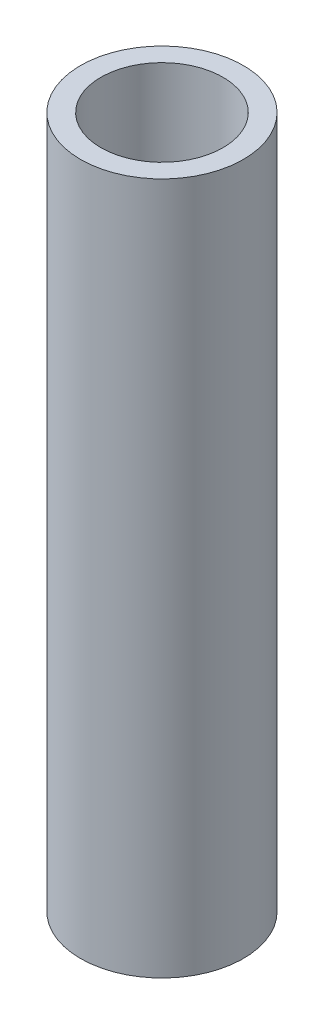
from build123d import *

# Parameters (mm, degrees)
SKETCH_1_R      = 12
SKETCH_1_R_2    = 9
EXTRUDE_1_DEPTH = 51


with BuildPart() as part:
    # Sketch 1 → Extrude 1 (new, symmetric)
    with BuildSketch(Plane(origin=(0, 0, 0), x_dir=(1, 0, 0), z_dir=(0, 1, 0))):
        with Locations(Location((0, 0, 0), (0, 0, 270))):
            Circle(SKETCH_1_R)
        with Locations(Location((0, 0, 0), (0, 0, 270))):
            Circle(SKETCH_1_R_2, mode=Mode.SUBTRACT)
    extrude(amount=EXTRUDE_1_DEPTH, both=True)


solid = part.part
